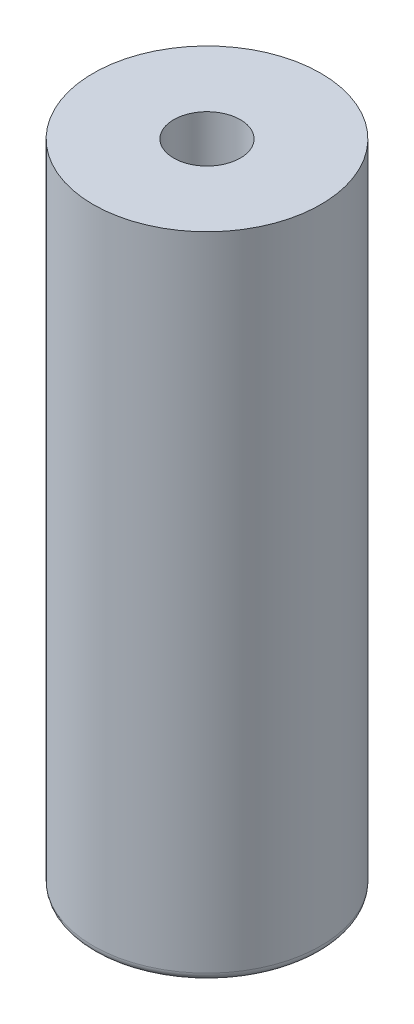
from build123d import *

# Parameters (mm, degrees)
FILLET_1_R = 0.5


with BuildPart() as part:
    # Sketch 1 → Revolve 1 (revolve)
    with BuildSketch(Plane.XY, mode=Mode.PRIVATE) as revolve_1_sk:
        Polygon((-7, 0), (-2.05, 0), (-2.05, -4), (-3.8, -4), (-3.8, -40), (-7, -40), align=None)
    revolve(revolve_1_sk.sketch.rotate(Axis((0, 0, 0), (0, 1, 0)), 270), axis=Axis((0, 0, 0), (0, 1, 0)))

    # Fillet 1
    fillet_1_edges = [part.edges().sort_by_distance(p)[0] for p in [
        (0, -40, 7),
        (0, -40, 3.8),
    ]]
    fillet(fillet_1_edges, radius=FILLET_1_R)


solid = part.part
